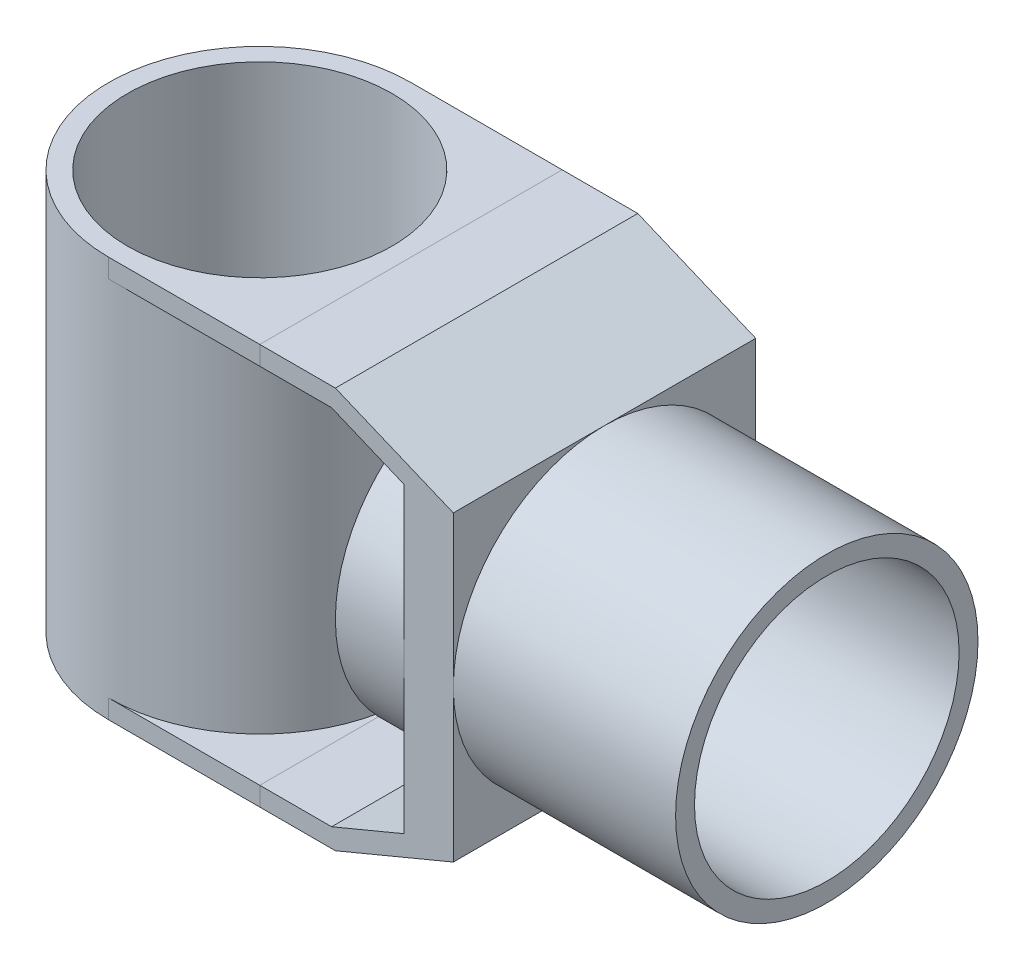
from build123d import *

# Parameters (mm, degrees)
SKETCH1_R                = 80
SKETCH1_R_2              = 70
BOSS_EXTRUDE1_DEPTH      = 106
SKETCH2_R                = 80
SKETCH2_R_2              = 70
BOSS_EXTRUDE2_DEPTH      = 180
BOSS_EXTRUDE4_DEPTH      = 80
BOSS_EXTRUDE4_2_DEPTH    = 80
BOSS_EXTRUDE8_REACH      = 258.975
BOSS_EXTRUDE8_END_RADIUS = 80
SKETCH6_W                = 160
SKETCH6_H                = 10
BOSS_EXTRUDE9_REACH      = 286.598
SKETCH7_W                = 26
SKETCH7_H                = 160
BOSS_EXTRUDE10_REACH     = 286.598
SKETCH9_W                = 26
SKETCH9_H                = 160


with BuildPart() as part:
    # Sketch1 → Boss-Extrude1 (new, symmetric)
    with BuildSketch(Plane(origin=(0, 0, 0), x_dir=(1, 0, 0), z_dir=(0, 1, 0))):
        with Locations(Location((-120, 0, 0), (0, 0, 270))):
            Circle(SKETCH1_R)
        with Locations(Location((-120, 0, 0), (0, 0, 270))):
            Circle(SKETCH1_R_2, mode=Mode.SUBTRACT)
    extrude(amount=BOSS_EXTRUDE1_DEPTH, both=True)

    # Boss-Extrude8: up to this cylinder (the profile starts outside it)
    boss_extrude8_end = Plane(origin=(-120, 0, 0), z_dir=(0, -1, 0)) * Cylinder(BOSS_EXTRUDE8_END_RADIUS, 880.95, mode=Mode.PRIVATE)
    # Sketch6 → Boss-Extrude8 (add, up to the surface)
    with BuildSketch(Plane.ZY.offset(40), mode=Mode.PRIVATE) as boss_extrude8_sk1:
        with Locations((0, -101)):
            Rectangle(SKETCH6_W, SKETCH6_H)
    boss_extrude8_tool1 = extrude(boss_extrude8_sk1.sketch, amount=BOSS_EXTRUDE8_REACH, mode=Mode.PRIVATE) - boss_extrude8_end
    add(boss_extrude8_tool1.solids().sort_by_distance((-40, -101, 0))[0])
    add(boss_extrude8_tool1.solids().sort_by_distance((-40, -101, 0))[1])
    # Sketch6 → Boss-Extrude8 (add, up to the surface)
    with BuildSketch(Plane.ZY.offset(40), mode=Mode.PRIVATE) as boss_extrude8_sk2:
        with Locations((0, 101)):
            Rectangle(SKETCH6_W, SKETCH6_H)
    boss_extrude8_tool2 = extrude(boss_extrude8_sk2.sketch, amount=BOSS_EXTRUDE8_REACH, mode=Mode.PRIVATE) - boss_extrude8_end
    add(boss_extrude8_tool2.solids().sort_by_distance((-40, 101, 0))[0])
    add(boss_extrude8_tool2.solids().sort_by_distance((-40, 101, 0))[1])


with BuildPart() as body_2:
    # Sketch2 → Boss-Extrude2 (new body)
    with BuildSketch(Plane.ZY):
        Circle(SKETCH2_R)
        Circle(SKETCH2_R_2, mode=Mode.SUBTRACT)
    extrude(amount=-BOSS_EXTRUDE2_DEPTH)

    # Sketch7 → Boss-Extrude9 (add, up to next)
    with BuildSketch(Plane(origin=(0, -80, 0), x_dir=(1, 0, 0), z_dir=(0, 1, 0)), mode=Mode.PRIVATE) as boss_extrude9_sk1:
        with Locations((49.4, 0)):
            Rectangle(SKETCH7_W, SKETCH7_H)
    boss_extrude9_tool1 = extrude(boss_extrude9_sk1.sketch, amount=BOSS_EXTRUDE9_REACH, mode=Mode.PRIVATE) - body_2.part


with BuildPart() as body_3:
    # Sketch4 → Boss-Extrude4 (new, symmetric)
    with BuildSketch(Plane.XY):
        Polygon((-40, 106), (0, 106), (62.4, 80), (36.4, 80), (-2, 96), (-40, 96), align=None)
    extrude(amount=BOSS_EXTRUDE4_DEPTH, both=True)


with BuildPart() as body_4:
    # Sketch4 → Boss-Extrude4 2 (new, symmetric)
    with BuildSketch(Plane.XY):
        Polygon((-40, -106), (0, -106), (62.4, -80), (36.4, -80), (-2, -96), (-40, -96), align=None)
    extrude(amount=BOSS_EXTRUDE4_2_DEPTH, both=True)


with BuildPart() as body_2_1:
    add(body_2.part)

    add(body_4.part)  # Boss-Extrude9 merges body 4
    add(boss_extrude9_tool1.solids().sort_by_distance((49.4, -80, 0))[0])
    add(boss_extrude9_tool1.solids().sort_by_distance((49.4, -80, 0))[1])

    # Sketch9 → Boss-Extrude10 (add, up to next)
    with BuildSketch(Plane.XZ.offset(-80), mode=Mode.PRIVATE) as boss_extrude10_sk1:
        with Locations((49.4, 0)):
            Rectangle(SKETCH9_W, SKETCH9_H)
    boss_extrude10_tool1 = extrude(boss_extrude10_sk1.sketch, amount=BOSS_EXTRUDE10_REACH, mode=Mode.PRIVATE) - body_2_1.part

    add(body_3.part)  # Boss-Extrude10 merges body 3
    add(boss_extrude10_tool1.solids().sort_by_distance((49.4, 80, 0))[0])
    add(boss_extrude10_tool1.solids().sort_by_distance((49.4, 80, 0))[1])


solid = Compound([part.part, body_2_1.part])
